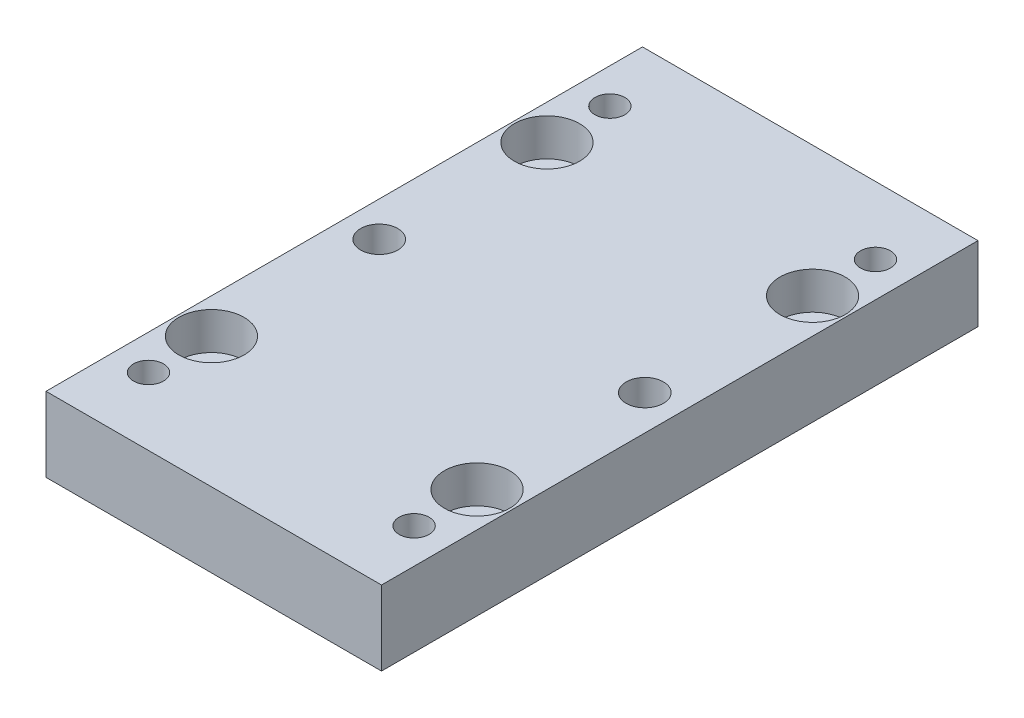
from build123d import *

# Parameters (mm, degrees)
SKETCH1_W                                        = 57.15
SKETCH1_H                                        = 101.6
BOSS_EXTRUDE1_DEPTH                              = 12.7
CBORE_FOR_1_4_SOCKET_HEAD_CAP_SCREW1_D           = 6.7564
CBORE_FOR_1_4_SOCKET_HEAD_CAP_SCREW1_CBORE_D     = 11.1125
CBORE_FOR_1_4_SOCKET_HEAD_CAP_SCREW1_CBORE_DEPTH = 6.35
F_1_4_0_2500_DOWEL_HOLE1_D                       = 6.35
F_1_4_20_TAPPED_HOLE1_D                          = 5.1054


with BuildPart() as part:
    # Sketch1 → Boss-Extrude1 (new body)
    with BuildSketch(Plane(origin=(0, 0, 0), x_dir=(1, 0, 0), z_dir=(0, 1, 0))):
        Rectangle(SKETCH1_W, SKETCH1_H)
    extrude(amount=BOSS_EXTRUDE1_DEPTH)

    # CBORE for 1_4 Socket Head Cap Screw1 (through all)
    with Locations(Plane(origin=(0, 12.7, 0), x_dir=(1, 0, 0), z_dir=(0, 1, 0))):
        with Locations((22.6187, -28.575), (22.6187, 28.575), (-22.6187, 28.575), (-22.6187, -28.575)):
            CounterBoreHole(CBORE_FOR_1_4_SOCKET_HEAD_CAP_SCREW1_D / 2, CBORE_FOR_1_4_SOCKET_HEAD_CAP_SCREW1_CBORE_D / 2, CBORE_FOR_1_4_SOCKET_HEAD_CAP_SCREW1_CBORE_DEPTH)

    # 1_4 _0.2500_ Dowel Hole1 (through all)
    with Locations(Plane(origin=(0, 12.7, 0), x_dir=(1, 0, 0), z_dir=(0, 1, 0))):
        with Locations((22.6187, 0), (-22.6187, 0)):
            Hole(F_1_4_0_2500_DOWEL_HOLE1_D / 2)

    # 1_4-20 Tapped Hole1 (through all)
    with Locations(Plane(origin=(0, 12.7, 0), x_dir=(1, 0, 0), z_dir=(0, 1, 0))):
        with Locations((-22.6187, -39.2938), (22.6187, -39.2938), (-22.6187, 39.2938), (22.6187, 39.2938)):
            Hole(F_1_4_20_TAPPED_HOLE1_D / 2)


solid = part.part
